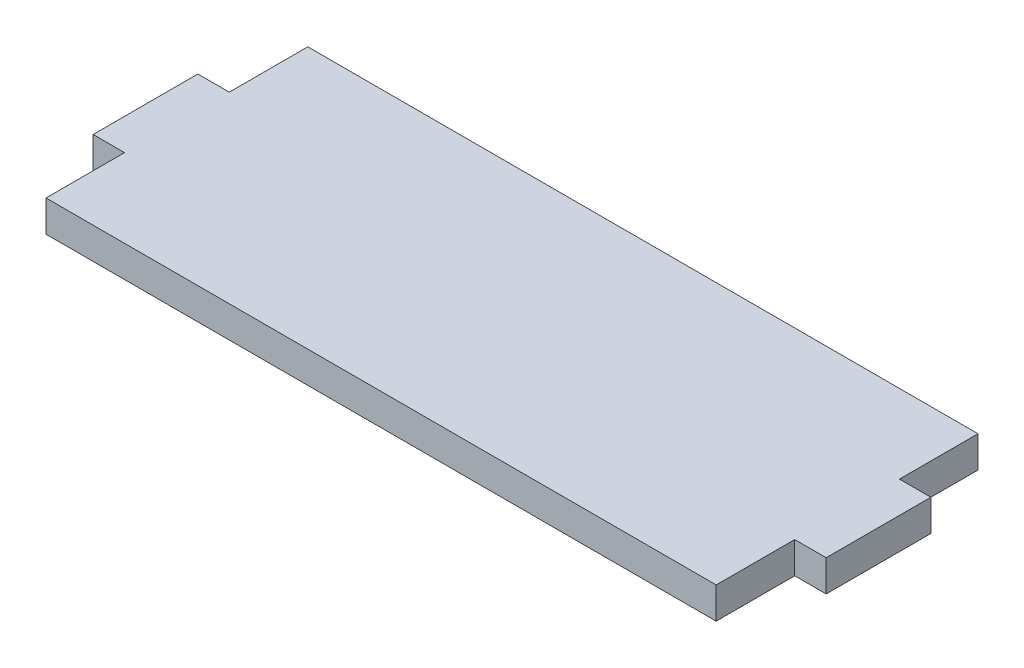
from build123d import *

# Parameters (mm, degrees)
BOSS_EXTRUDE1_DEPTH = 3


with BuildPart() as part:
    # Sketch1 → Boss-Extrude1 (new body)
    with BuildSketch(Plane(origin=(0, 0, 0), x_dir=(1, 0, 0), z_dir=(0, 1, 0))):
        Polygon((28.171045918, -14.694861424), (28.171045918, -7.194861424), (-35.828954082, -7.194861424), (-35.828954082, -14.694861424), (-38.828954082, -14.694861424), (-38.828954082, -24.694861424), (-35.828954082, -24.694861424), (-35.828954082, -32.194861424), (28.171045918, -32.194861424), (28.171045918, -24.694861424), (31.171045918, -24.694861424), (31.171045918, -14.694861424), align=None)
    extrude(amount=BOSS_EXTRUDE1_DEPTH)


solid = part.part
